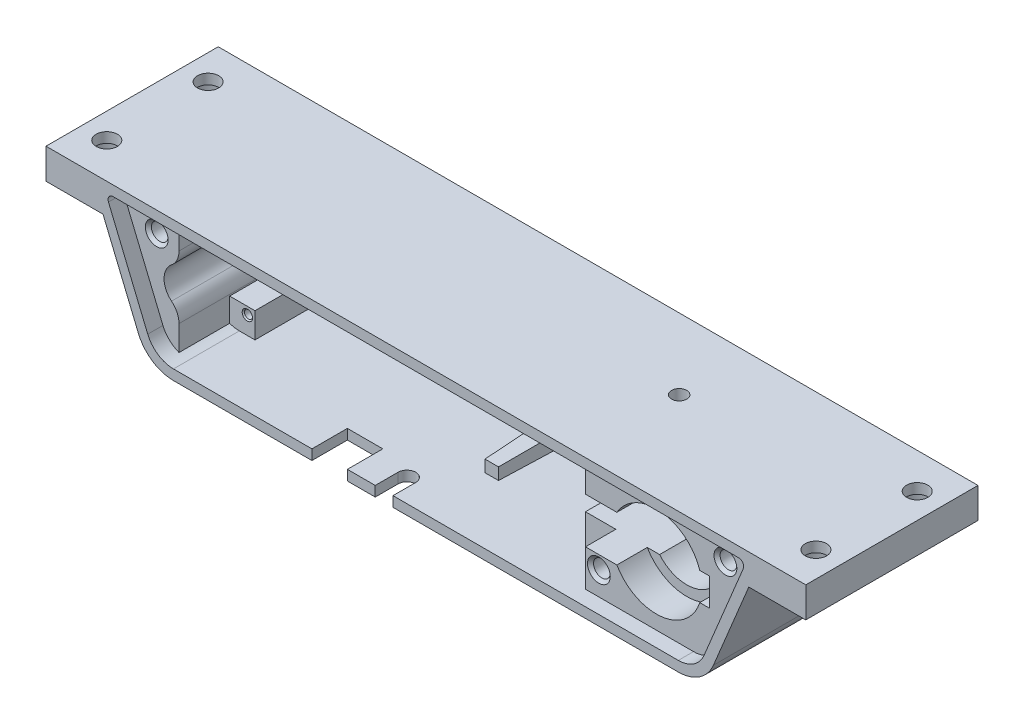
from build123d import *

# Parameters (mm, degrees)
BOSS_EXTRU_1_DEPTH                                 = 34
ENL_V_MAT_EXTRU_1_DEPTH                            = 32
ESQUISSE3_W                                        = 4
ESQUISSE3_H                                        = 3
BOSS_EXTRU_2_DEPTH                                 = 19
D_POUILLE1_ANGLE                                   = 2
BOSS_EXTRU_3_START                                 = 23
BOSS_EXTRU_3_DEPTH                                 = 23
BOSS_EXTRU_4_START                                 = 6
BOSS_EXTRU_4_DEPTH                                 = 6
BOSS_EXTRU_5_START                                 = 29
BOSS_EXTRU_5_DEPTH                                 = 29
CONG_1_R                                           = 4
ESQUISSE7_W                                        = 5
ESQUISSE7_H                                        = 5
BOSS_EXTRU_6_DEPTH                                 = 23
BOSS_EXTRU_7_START                                 = 19
BOSS_EXTRU_7_DEPTH                                 = 19
TROU_TARAUD_M41_D                                  = 3.3
TROU_TARAUD_M41_DEPTH                              = 7.5
TROU_TARAUD_M41_CSINK_D                            = 4.5
TROU_TARAUD_M41_CSINK_ANGLE                        = 90
TROU_TARAUD_M41_TIP                                = 0.991420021
CONG_2_R                                           = 1
ESQUISSE11_W                                       = 7
ESQUISSE11_H                                       = 2
ENL_V_MAT_EXTRU_2_DEPTH                            = 7
ENL_V_MAT_EXTRU_3_REACH                            = 88.817
ENL_V_MAT_EXTRU_4_REACH                            = 88.817
ESQUISSE13_R                                       = 1.5
CHAMBRAGE_POUR_VIS_T_TE_HEXAGONALE_M41_D           = 4.2
CHAMBRAGE_POUR_VIS_T_TE_HEXAGONALE_M41_CBORE_D     = 8.5
CHAMBRAGE_POUR_VIS_T_TE_HEXAGONALE_M41_CBORE_DEPTH = 4
TROU_TARAUD_M21_D                                  = 1.6
TROU_TARAUD_M21_DEPTH                              = 6
TROU_TARAUD_M21_CSINK_D                            = 2.05
TROU_TARAUD_M21_CSINK_ANGLE                        = 90
TROU_TARAUD_M21_TIP                                = 0.480688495
ENL_V_MAT_EXTRU_5_REACH                            = 88.054
ESQUISSE24_R                                       = 4


with BuildPart() as part:
    # Esquisse1 → Boss.-Extru.1 (new body)
    with BuildSketch(Plane.XY):
        with BuildLine():
            Line((-75, 0), (75, 0))
            Line((75, 0), (75, -6))
            Line((75, -6), (63.75, -6))
            Line((63.75, -6), (56.762165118, -22.870125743))
            ThreePointArc((56.762165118, -22.870125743), (53.999845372, -26.236022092), (49.833068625, -27.5))
            Line((49.833068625, -27.5), (-49.833068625, -27.5))
            ThreePointArc((-49.833068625, -27.5), (-53.999845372, -26.236022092), (-56.762165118, -22.870125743))
            Line((-56.762165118, -22.870125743), (-63.75, -6))
            Line((-63.75, -6), (-75, -6))
            Line((-75, -6), (-75, 0))
        make_face()
    extrude(amount=BOSS_EXTRU_1_DEPTH)

    # Esquisse2 → Enl_v. mat.-Extru.1 (cut)
    with BuildSketch(Plane.XY.offset(34)):
        with BuildLine():
            Line((-63.242069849, -2), (-54.914406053, -22.104758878))
            ThreePointArc((-54.914406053, -22.104758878), (-52.888704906, -24.573082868), (-49.833068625, -25.5))
            Line((-49.833068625, -25.5), (49.833068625, -25.5))
            ThreePointArc((49.833068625, -25.5), (52.888704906, -24.573082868), (54.914406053, -22.104758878))
            Line((54.914406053, -22.104758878), (63.242069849, -2))
            Line((63.242069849, -2), (-63.242069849, -2))
        make_face()
    extrude(amount=-ENL_V_MAT_EXTRU_1_DEPTH, mode=Mode.SUBTRACT)

    # Esquisse3 → Boss.-Extru.2 (add)
    with BuildSketch(Plane.XY.offset(2)):
        with Locations((0, -3.5)):
            Rectangle(ESQUISSE3_W, ESQUISSE3_H)
        with Locations((0, -24)):
            Rectangle(ESQUISSE3_W, ESQUISSE3_H)
    extrude(amount=BOSS_EXTRU_2_DEPTH)

    # D_pouille1
    d_pouille1_faces = [part.faces().sort_by_distance(p)[0] for p in [
        (2, -24, 11.5),
        (0, -22.5, 11.5),
        (-2, -24, 11.5),
        (-2, -3.5, 11.5),
        (2, -3.5, 11.5),
        (0, -5, 11.5),
    ]]
    draft(d_pouille1_faces, Plane(origin=(49.833068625, -20, 2), x_dir=(1, 0, 0), z_dir=(0, 0, 1)), D_POUILLE1_ANGLE)

    # Esquisse4 → Boss.-Extru.3 (add)
    with BuildSketch(Plane.XY.offset(2).offset(BOSS_EXTRU_3_START)):
        with BuildLine():
            Line((22.5, -2), (22.5, -9.25))
            Line((22.5, -9.25), (37.138097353, -9.25))
            ThreePointArc((37.138097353, -9.25), (43.526980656, -6.825744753), (48.937196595, -11))
            Line((48.937196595, -11), (53, -11))
            Line((53, -11), (53, -16.5))
            Line((53, -16.5), (48.937196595, -16.5))
            ThreePointArc((48.937196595, -16.5), (43.526980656, -20.674255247), (37.138097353, -18.25))
            Line((37.138097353, -18.25), (22.5, -18.25))
            Line((22.5, -18.25), (22.5, -25.5))
            Line((22.5, -25.5), (49.833068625, -25.5))
            ThreePointArc((49.833068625, -25.5), (52.888704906, -24.573082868), (54.914406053, -22.104758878))
            Line((54.914406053, -22.104758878), (63.242069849, -2))
            Line((63.242069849, -2), (22.5, -2))
        make_face()
    extrude(amount=-BOSS_EXTRU_3_DEPTH)

    # Esquisse5 → Boss.-Extru.4 (add)
    with BuildSketch(Plane.XY.offset(25).offset(BOSS_EXTRU_4_START)):
        with BuildLine():
            Line((28.5, -2), (28.5, -9.25))
            Line((28.5, -9.25), (34.705771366, -9.25))
            ThreePointArc((34.705771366, -9.25), (43.457033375, -4.801028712), (51.069568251, -11))
            Line((51.069568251, -11), (53, -11))
            Line((53, -11), (53, -16.5))
            Line((53, -16.5), (51.069568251, -16.5))
            ThreePointArc((51.069568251, -16.5), (43.457033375, -22.698971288), (34.705771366, -18.25))
            Line((34.705771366, -18.25), (28.5, -18.25))
            Line((28.5, -18.25), (28.5, -25.5))
            Line((28.5, -25.5), (49.833068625, -25.5))
            ThreePointArc((49.833068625, -25.5), (52.888704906, -24.573082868), (54.914406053, -22.104758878))
            Line((54.914406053, -22.104758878), (63.242069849, -2))
            Line((63.242069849, -2), (28.5, -2))
        make_face()
    extrude(amount=-BOSS_EXTRU_4_DEPTH)

    # Esquisse6 → Boss.-Extru.5 (add)
    with BuildSketch(Plane.XY.offset(2).offset(BOSS_EXTRU_5_START)):
        with BuildLine():
            Line((-51.742069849, -2), (-51.742069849, -10.139540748))
            ThreePointArc((-51.742069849, -10.139540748), (-54.694761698, -14), (-51.742069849, -17.860459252))
            Line((-51.742069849, -17.860459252), (-51.742069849, -25.158072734))
            ThreePointArc((-51.742069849, -25.158072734), (-53.647107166, -23.962714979), (-54.914406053, -22.104758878))
            Line((-54.914406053, -22.104758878), (-63.242069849, -2))
            Line((-63.242069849, -2), (-51.742069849, -2))
        make_face()
    extrude(amount=-BOSS_EXTRU_5_DEPTH)

    # Cong_1
    cong_1_edges = [part.edges().sort_by_distance(p)[0] for p in [
        (-51.742069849, -17.860459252, 16.5),
        (-51.742069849, -10.139540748, 16.5),
    ]]
    fillet(cong_1_edges, radius=CONG_1_R)

    # Esquisse7 → Boss.-Extru.6 (add)
    with BuildSketch(Plane.XY.offset(2)):
        with Locations((-49.242069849, -4.5)):
            Rectangle(ESQUISSE7_W, ESQUISSE7_H)
    extrude(amount=BOSS_EXTRU_6_DEPTH)

    # Esquisse23 → Boss.-Extru.7 (add)
    with BuildSketch(Plane.XY.offset(2).offset(BOSS_EXTRU_7_START)):
        with BuildLine():
            Line((-51.742069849, -20.5), (-46.742069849, -20.5))
            Line((-46.742069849, -20.5), (-46.742069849, -25.5))
            Line((-46.742069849, -25.5), (-49.833068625, -25.5))
            ThreePointArc((-49.833068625, -25.5), (-50.802759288, -25.413843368), (-51.742069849, -25.158072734))
            Line((-51.742069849, -25.158072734), (-51.742069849, -20.5))
        make_face()
    extrude(amount=-BOSS_EXTRU_7_DEPTH)

    # Trou taraud_ M41
    with Locations(Plane.XY.offset(31)):
        with Locations((-56.137878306, -7), (31.15, -20.9), (56.137878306, -7)):
            CounterSinkHole(TROU_TARAUD_M41_D / 2, TROU_TARAUD_M41_CSINK_D / 2, depth=TROU_TARAUD_M41_DEPTH, counter_sink_angle=TROU_TARAUD_M41_CSINK_ANGLE)
            with Locations((0, 0, -(TROU_TARAUD_M41_DEPTH + TROU_TARAUD_M41_TIP / 2))):  # 118° drill point
                Cone(0, TROU_TARAUD_M41_D / 2, TROU_TARAUD_M41_TIP, mode=Mode.SUBTRACT)

    # Cong_2
    cong_2_edges = [part.edges().sort_by_distance(p)[0] for p in [
        (63.242069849, -2, 32.5),
        (-63.242069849, -2, 32.5),
    ]]
    fillet(cong_2_edges, radius=CONG_2_R)

    # Esquisse11 → Enl_v. mat.-Extru.2 (cut)
    with BuildSketch(Plane.XY.offset(34)):
        with Locations((-19, -26.5)):
            Rectangle(ESQUISSE11_W, ESQUISSE11_H)
    extrude(amount=-ENL_V_MAT_EXTRU_2_DEPTH, mode=Mode.SUBTRACT)

    # Esquisse12 → Enl_v. mat.-Extru.3 (cut, up to next)
    with BuildSketch(Plane.XZ.offset(27.5), mode=Mode.PRIVATE) as enl_v_mat_extru_3_sk1:
        with BuildLine():
            Line((-10, 34), (-10, 29.5))
            ThreePointArc((-10, 29.5), (-8.25, 27.75), (-6.5, 29.5))
            Line((-6.5, 29.5), (-6.5, 34))
            Line((-6.5, 34), (-10, 34))
        make_face()
    enl_v_mat_extru_3_tool1 = extrude(enl_v_mat_extru_3_sk1.sketch, amount=-ENL_V_MAT_EXTRU_3_REACH, mode=Mode.PRIVATE) & part.part
    add(enl_v_mat_extru_3_tool1.solids().sort_by_distance((-8.25, -27.5, 31.049791))[0], mode=Mode.SUBTRACT)

    # Enl_v. mat.-Extru.4: up to this face of the body (flat: up to its plane)
    enl_v_mat_extru_4_end = Plane(part.part.faces().sort_by_distance((0, 0, 17))[0])
    # Esquisse13 → Enl_v. mat.-Extru.4 (cut, up to the picked face)
    with BuildSketch(Plane.XZ.offset(27.5), mode=Mode.PRIVATE) as enl_v_mat_extru_4_sk1:
        with Locations(Location((30, 14, 0), (0, 0, 270))):
            Circle(ESQUISSE13_R)
    enl_v_mat_extru_4_tool1 = split(extrude(enl_v_mat_extru_4_sk1.sketch, amount=-ENL_V_MAT_EXTRU_4_REACH, mode=Mode.PRIVATE), bisect_by=enl_v_mat_extru_4_end, keep=Keep.BOTH, mode=Mode.PRIVATE)
    add(enl_v_mat_extru_4_tool1.solids().sort_by(Axis((30, -27.5, 14), (0, 1, 0)))[0], mode=Mode.SUBTRACT)

    # Chambrage pour vis _ t_te hexagonale M41 (through all)
    with Locations(Plane(origin=(0, -6, 0), x_dir=(-1, 0, 0), z_dir=(0, -1, 0))):
        with Locations((70, -27), (70, -7), (-70, -27), (-70, -7)):
            CounterBoreHole(CHAMBRAGE_POUR_VIS_T_TE_HEXAGONALE_M41_D / 2, CHAMBRAGE_POUR_VIS_T_TE_HEXAGONALE_M41_CBORE_D / 2, CHAMBRAGE_POUR_VIS_T_TE_HEXAGONALE_M41_CBORE_DEPTH)

    # Trou taraud_ M21
    with Locations(Plane.XY.offset(21)):
        with Locations((-48.242069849, -22)):
            CounterSinkHole(TROU_TARAUD_M21_D / 2, TROU_TARAUD_M21_CSINK_D / 2, depth=TROU_TARAUD_M21_DEPTH, counter_sink_angle=TROU_TARAUD_M21_CSINK_ANGLE)
            with Locations((0, 0, -(TROU_TARAUD_M21_DEPTH + TROU_TARAUD_M21_TIP / 2))):  # 118° drill point
                Cone(0, TROU_TARAUD_M21_D / 2, TROU_TARAUD_M21_TIP, mode=Mode.SUBTRACT)

    # Esquisse24 → Enl_v. mat.-Extru.5 (cut, up to next)
    with BuildSketch(Plane.XY.offset(2), mode=Mode.PRIVATE) as enl_v_mat_extru_5_sk1:
        with Locations(Location((-50.694761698, -14, 0), (0, 0, 129.1175525))):
            Circle(ESQUISSE24_R)
    enl_v_mat_extru_5_tool1 = extrude(enl_v_mat_extru_5_sk1.sketch, amount=-ENL_V_MAT_EXTRU_5_REACH, mode=Mode.PRIVATE) & part.part
    add(enl_v_mat_extru_5_tool1.solids().sort_by_distance((-50.694762, -14, 2))[0], mode=Mode.SUBTRACT)


solid = part.part
